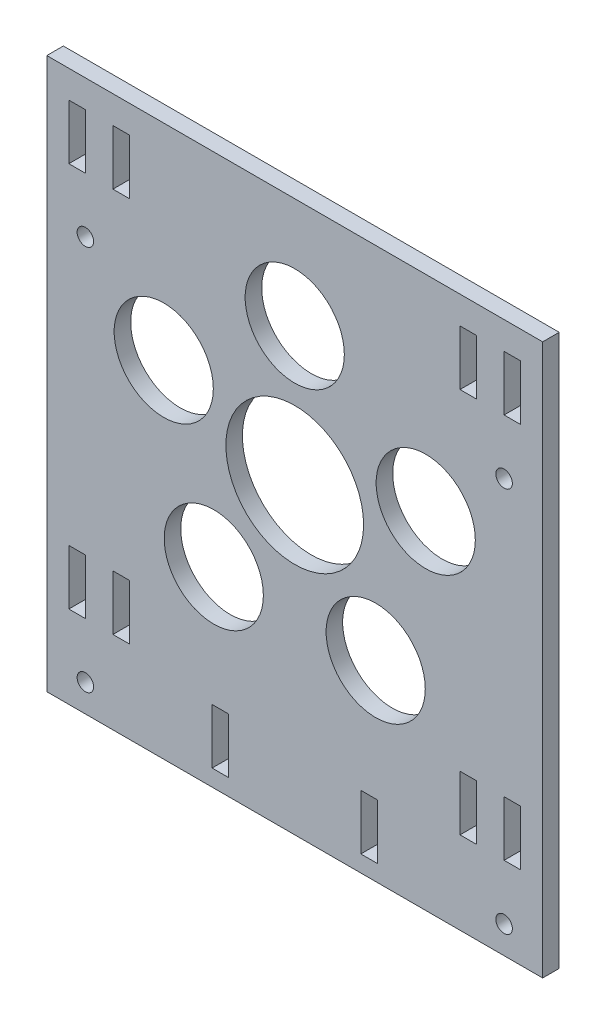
from build123d import *

# Parameters (mm, degrees)
EXTRUDE_2_DEPTH     = 3
SKETCH_5_W          = 3
SKETCH_5_H          = 10
CUT_EXTRUDE_1_DEPTH = 10
SKETCH_6_R          = 9
CUT_EXTRUDE_2_DEPTH = 10
SKETCH_7_R          = 12.5
CUT_EXTRUDE_3_DEPTH = 10
SKETCH_8_R          = 1.5
SKETCH_8_W          = 3
SKETCH_8_H          = 10
CUT_EXTRUDE_4_DEPTH = 10


with BuildPart() as part:
    # Sketch 3 → Extrude 2 (new body)
    with BuildSketch(Plane.XY):
        Polygon((45, 45), (-45, 45), (-45, -45), (-45, -55), (45, -55), (45, -45), align=None)
    extrude(amount=EXTRUDE_2_DEPTH)

    # Sketch 5 → Cut-Extrude 1 (cut)
    with BuildSketch(Plane.XY.offset(3)):
        with Locations((-31.5, 35)):
            Rectangle(SKETCH_5_W, SKETCH_5_H)
        with Locations((31.5, 35)):
            Rectangle(SKETCH_5_W, SKETCH_5_H)
        with Locations((-31.5, -35)):
            Rectangle(SKETCH_5_W, SKETCH_5_H)
        with Locations((31.5, -35)):
            Rectangle(SKETCH_5_W, SKETCH_5_H)
    extrude(amount=-CUT_EXTRUDE_1_DEPTH, mode=Mode.SUBTRACT)

    # Sketch 6 → Cut-Extrude 2 (cut)
    with BuildSketch(Plane.XY.offset(3)):
        with Locations((23.776412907, 7.725424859)):
            Circle(SKETCH_6_R)
        with Locations((14.694631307, -20.225424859)):
            Circle(SKETCH_6_R)
        with Locations((-14.694631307, -20.225424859)):
            Circle(SKETCH_6_R)
        with Locations((0, 25)):
            Circle(SKETCH_6_R)
        with Locations((-23.776412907, 7.725424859)):
            Circle(SKETCH_6_R)
    extrude(amount=-CUT_EXTRUDE_2_DEPTH, mode=Mode.SUBTRACT)

    # Sketch 7 → Cut-Extrude 3 (cut)
    with BuildSketch(Plane.XY.offset(3)):
        Circle(SKETCH_7_R)
    extrude(amount=-CUT_EXTRUDE_3_DEPTH, mode=Mode.SUBTRACT)

    # Sketch 8 → Cut-Extrude 4 (cut)
    with BuildSketch(Plane.XY.offset(3)):
        with Locations((-38, -50)):
            Circle(SKETCH_8_R)
        with Locations((-38, 20)):
            Circle(SKETCH_8_R)
        with Locations((38, 20)):
            Circle(SKETCH_8_R)
        with Locations((38, -50)):
            Circle(SKETCH_8_R)
        with Locations((-39.5, -35)):
            Rectangle(SKETCH_8_W, SKETCH_8_H)
        with Locations((-39.5, 35)):
            Rectangle(SKETCH_8_W, SKETCH_8_H)
        with Locations((-13.5, -47)):
            Rectangle(SKETCH_8_W, SKETCH_8_H)
        with Locations((13.5, -47)):
            Rectangle(SKETCH_8_W, SKETCH_8_H)
        with Locations((39.5, 35)):
            Rectangle(SKETCH_8_W, SKETCH_8_H)
        with Locations((39.5, -35)):
            Rectangle(SKETCH_8_W, SKETCH_8_H)
    extrude(amount=-CUT_EXTRUDE_4_DEPTH, mode=Mode.SUBTRACT)


solid = part.part
